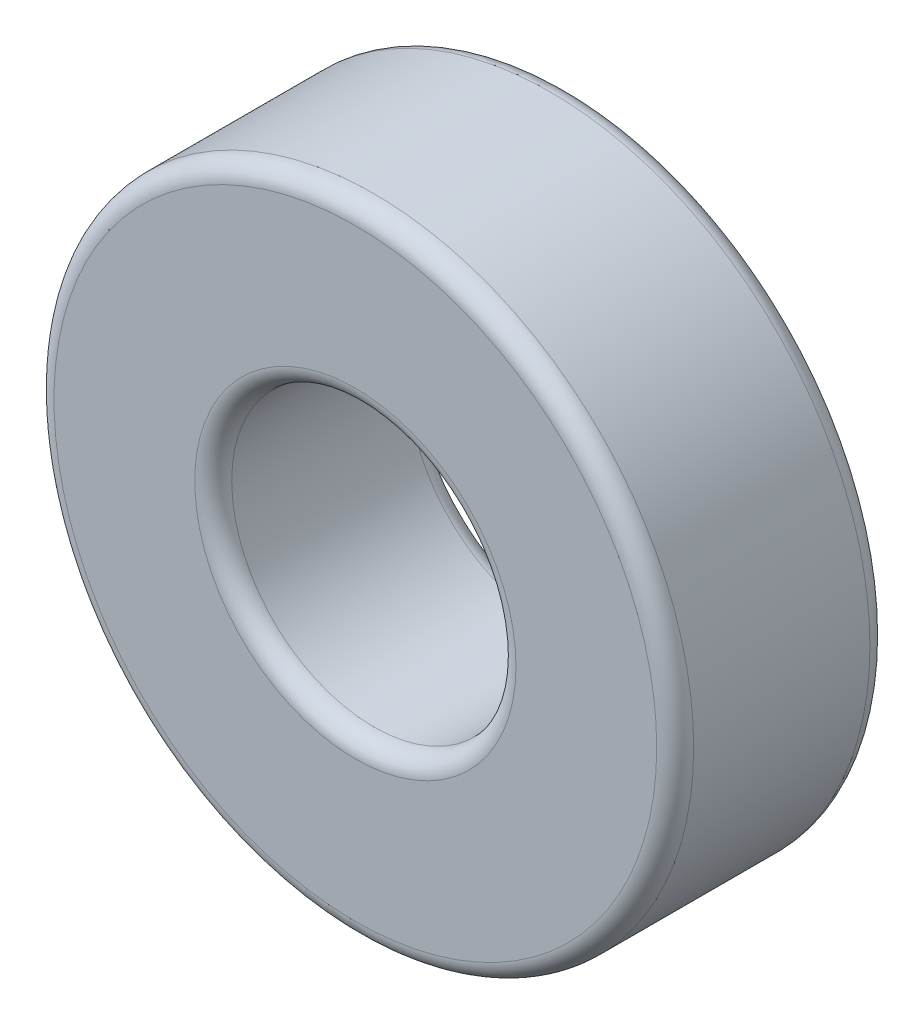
from build123d import *

# Parameters (mm, degrees)
SKETCH1_R      = 14.2875
SKETCH1_R_2    = 6.35
EXTRUDE1_DEPTH = 4.7625
FILLET1_R      = 0.8255


with BuildPart() as part:
    # Sketch1 → Extrude1 (new, symmetric)
    with BuildSketch(Plane.XY):
        with Locations(Location((0, 0, 0), (0, 0, 180))):
            Circle(SKETCH1_R)
        with Locations(Location((0, 0, 0), (0, 0, 180))):
            Circle(SKETCH1_R_2, mode=Mode.SUBTRACT)
    extrude(amount=EXTRUDE1_DEPTH, both=True)

    # Fillet1
    fillet1_edges = [part.edges().sort_by_distance(p)[0] for p in [
        (14.2875, 0, -4.7625),
        (14.2875, 0, 4.7625),
        (6.35, 0, -4.7625),
        (6.35, 0, 4.7625),
    ]]
    fillet(fillet1_edges, radius=FILLET1_R)


solid = part.part
